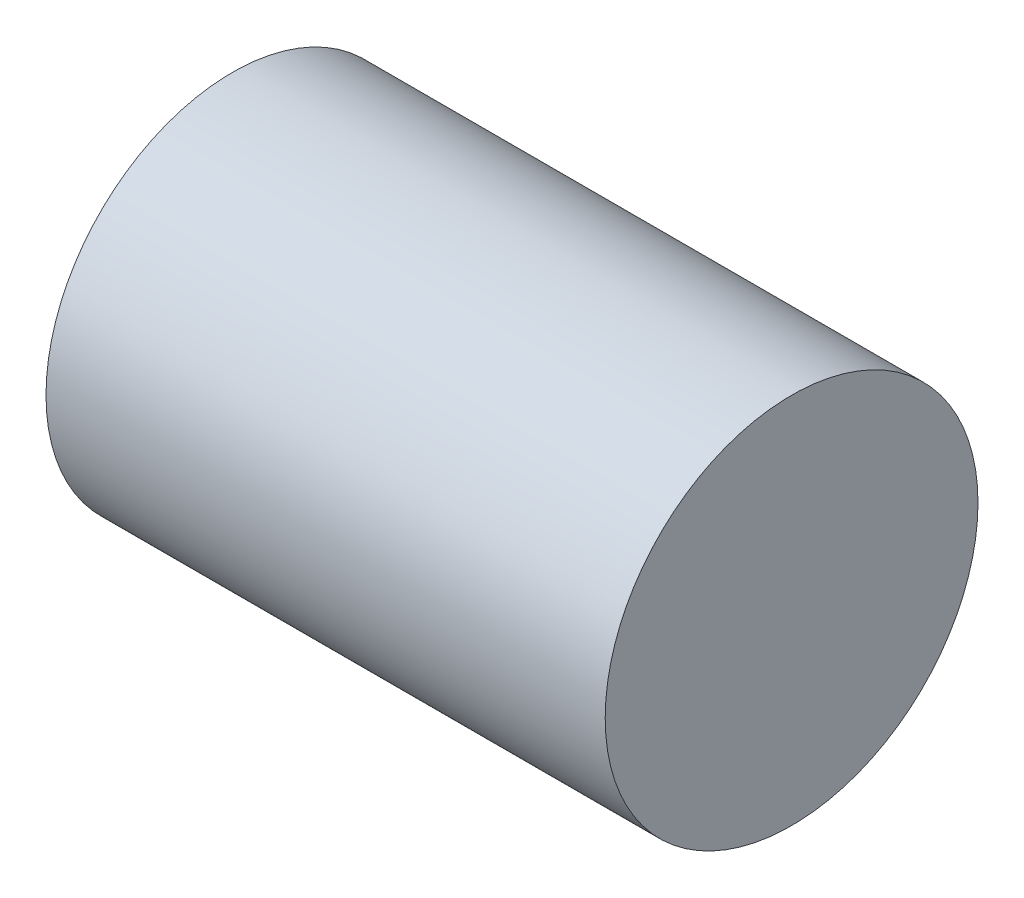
from build123d import *

# Parameters (mm, degrees)
SKETCH1_R           = 5
BOSS_EXTRUDE1_DEPTH = 15


with BuildPart() as part:
    # Sketch1 → Boss-Extrude1 (new body)
    with BuildSketch(Plane(origin=(0, 0, 0), x_dir=(0, 0, -1), z_dir=(1, 0, 0))):
        Circle(SKETCH1_R)
    extrude(amount=BOSS_EXTRUDE1_DEPTH)


solid = part.part
